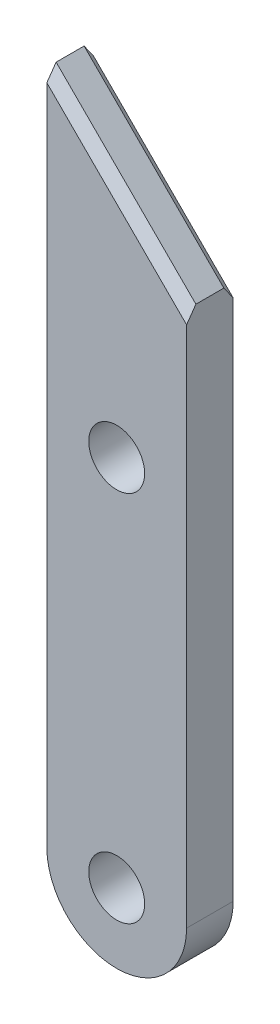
ISO-10303-21;
HEADER;
FILE_DESCRIPTION(('STEP AP214'),'2;1');
FILE_NAME('part.step','',(''),(''),'','','');
FILE_SCHEMA(('AUTOMOTIVE_DESIGN { 1 0 10303 214 1 1 1 1 }'));
ENDSEC;
DATA;
#1=APPLICATION_CONTEXT('core data for automotive mechanical design processes');
#2=APPLICATION_PROTOCOL_DEFINITION('international standard','automotive_design',2000,#1);
#3=PRODUCT_CONTEXT('',#1,'mechanical');
#4=PRODUCT('Part','Part','',(#3));
#5=PRODUCT_RELATED_PRODUCT_CATEGORY('part','',(#4));
#6=PRODUCT_DEFINITION_FORMATION('','',#4);
#7=PRODUCT_DEFINITION_CONTEXT('part definition',#1,'design');
#8=PRODUCT_DEFINITION('design','',#6,#7);
#9=PRODUCT_DEFINITION_SHAPE('','',#8);
#10=(LENGTH_UNIT() NAMED_UNIT(*) SI_UNIT(.MILLI.,.METRE.));
#11=(NAMED_UNIT(*) PLANE_ANGLE_UNIT() SI_UNIT($,.RADIAN.));
#12=(NAMED_UNIT(*) SI_UNIT($,.STERADIAN.) SOLID_ANGLE_UNIT());
#13=UNCERTAINTY_MEASURE_WITH_UNIT(LENGTH_MEASURE(1.E-05),#10,'distance_accuracy_value','');
#14=(GEOMETRIC_REPRESENTATION_CONTEXT(3) GLOBAL_UNCERTAINTY_ASSIGNED_CONTEXT((#13)) GLOBAL_UNIT_ASSIGNED_CONTEXT((#10,
#11,#12)) REPRESENTATION_CONTEXT('',''));
#15=CARTESIAN_POINT('',(0.,0.,0.));
#16=DIRECTION('',(0.,0.,1.));
#17=DIRECTION('',(1.,0.,0.));
#18=AXIS2_PLACEMENT_3D('',#15,#16,#17);
#19=CARTESIAN_POINT('',(0.,0.,10.));
#20=DIRECTION('',(1.,0.,0.));
#21=DIRECTION('',(0.,1.,0.));
#22=AXIS2_PLACEMENT_3D('',#19,#20,#21);
#23=PLANE('',#22);
#24=DIRECTION('',(0.,0.,-1.));
#25=VECTOR('',#24,1.);
#26=CARTESIAN_POINT('',(0.,0.,10.));
#27=LINE('',#26,#25);
#28=CARTESIAN_POINT('',(0.,0.,8.));
#29=VERTEX_POINT('',#28);
#30=CARTESIAN_POINT('',(0.,0.,1.99999999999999));
#31=VERTEX_POINT('',#30);
#32=EDGE_CURVE('E135',#29,#31,#27,.T.);
#33=ORIENTED_EDGE('',*,*,#32,.T.);
#34=DIRECTION('',(0.,0.816496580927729,0.577350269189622));
#35=VECTOR('',#34,1.);
#36=CARTESIAN_POINT('',(0.,0.,1.99999999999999));
#37=LINE('',#36,#35);
#38=CARTESIAN_POINT('',(0.,-2.82842712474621,0.));
#39=VERTEX_POINT('',#38);
#40=EDGE_CURVE('E123',#31,#39,#37,.F.);
#41=ORIENTED_EDGE('',*,*,#40,.T.);
#42=DIRECTION('',(0.,-1.,0.));
#43=VECTOR('',#42,1.);
#44=CARTESIAN_POINT('',(0.,0.,0.));
#45=LINE('',#44,#43);
#46=CARTESIAN_POINT('',(0.,-145.,0.));
#47=VERTEX_POINT('',#46);
#48=EDGE_CURVE('E109',#39,#47,#45,.T.);
#49=ORIENTED_EDGE('',*,*,#48,.T.);
#50=DIRECTION('',(0.,0.,-1.));
#51=VECTOR('',#50,1.);
#52=CARTESIAN_POINT('',(0.,-145.,10.));
#53=LINE('',#52,#51);
#54=CARTESIAN_POINT('',(0.,-145.,10.));
#55=VERTEX_POINT('',#54);
#56=EDGE_CURVE('E103',#55,#47,#53,.T.);
#57=ORIENTED_EDGE('',*,*,#56,.F.);
#58=DIRECTION('',(0.,-1.,0.));
#59=VECTOR('',#58,1.);
#60=CARTESIAN_POINT('',(0.,0.,10.));
#61=LINE('',#60,#59);
#62=CARTESIAN_POINT('',(0.,-2.82842712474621,10.));
#63=VERTEX_POINT('',#62);
#64=EDGE_CURVE('E90',#63,#55,#61,.T.);
#65=ORIENTED_EDGE('',*,*,#64,.F.);
#66=DIRECTION('',(0.,0.816496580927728,-0.577350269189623));
#67=VECTOR('',#66,1.);
#68=CARTESIAN_POINT('',(0.,-55.2189514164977,47.0456949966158));
#69=LINE('',#68,#67);
#70=EDGE_CURVE('E121',#63,#29,#69,.T.);
#71=ORIENTED_EDGE('',*,*,#70,.T.);
#72=EDGE_LOOP('',(#33,#41,#49,#57,#65,#71));
#73=FACE_BOUND('',#72,.T.);
#74=ADVANCED_FACE('F34',(#73),#23,.F.);
#75=CARTESIAN_POINT('',(15.,-145.,10.));
#76=DIRECTION('',(0.,0.,-1.));
#77=DIRECTION('',(-1.,0.,0.));
#78=AXIS2_PLACEMENT_3D('',#75,#76,#77);
#79=CYLINDRICAL_SURFACE('',#78,15.);
#80=CARTESIAN_POINT('',(15.,-145.,0.));
#81=DIRECTION('',(0.,0.,1.));
#82=DIRECTION('',(1.,0.,0.));
#83=AXIS2_PLACEMENT_3D('',#80,#81,#82);
#84=CIRCLE('',#83,15.);
#85=CARTESIAN_POINT('',(30.,-145.,0.));
#86=VERTEX_POINT('',#85);
#87=EDGE_CURVE('E138',#47,#86,#84,.T.);
#88=ORIENTED_EDGE('',*,*,#87,.T.);
#89=DIRECTION('',(0.,0.,-1.));
#90=VECTOR('',#89,1.);
#91=CARTESIAN_POINT('',(30.,-145.,10.));
#92=LINE('',#91,#90);
#93=CARTESIAN_POINT('',(30.,-145.,10.));
#94=VERTEX_POINT('',#93);
#95=EDGE_CURVE('E105',#94,#86,#92,.T.);
#96=ORIENTED_EDGE('',*,*,#95,.F.);
#97=CARTESIAN_POINT('',(15.,-145.,10.));
#98=DIRECTION('',(0.,0.,1.));
#99=DIRECTION('',(1.,0.,0.));
#100=AXIS2_PLACEMENT_3D('',#97,#98,#99);
#101=CIRCLE('',#100,15.);
#102=EDGE_CURVE('E93',#55,#94,#101,.T.);
#103=ORIENTED_EDGE('',*,*,#102,.F.);
#104=ORIENTED_EDGE('',*,*,#56,.T.);
#105=EDGE_LOOP('',(#88,#96,#103,#104));
#106=FACE_BOUND('',#105,.T.);
#107=ADVANCED_FACE('F102',(#106),#79,.T.);
#108=CARTESIAN_POINT('',(30.,-30.,10.));
#109=DIRECTION('',(-1.,0.,0.));
#110=DIRECTION('',(0.,-1.,0.));
#111=AXIS2_PLACEMENT_3D('',#108,#109,#110);
#112=PLANE('',#111);
#113=DIRECTION('',(0.,1.,0.));
#114=VECTOR('',#113,1.);
#115=CARTESIAN_POINT('',(30.,-30.,0.));
#116=LINE('',#115,#114);
#117=CARTESIAN_POINT('',(30.,-32.8284271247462,0.));
#118=VERTEX_POINT('',#117);
#119=EDGE_CURVE('E98',#86,#118,#116,.T.);
#120=ORIENTED_EDGE('',*,*,#119,.T.);
#121=DIRECTION('',(0.,-0.816496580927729,-0.577350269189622));
#122=VECTOR('',#121,1.);
#123=CARTESIAN_POINT('',(30.,-9.99999999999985,16.1421356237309));
#124=LINE('',#123,#122);
#125=CARTESIAN_POINT('',(30.,-30.,1.99999999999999));
#126=VERTEX_POINT('',#125);
#127=EDGE_CURVE('E42',#118,#126,#124,.F.);
#128=ORIENTED_EDGE('',*,*,#127,.T.);
#129=DIRECTION('',(0.,0.,-1.));
#130=VECTOR('',#129,1.);
#131=CARTESIAN_POINT('',(30.,-30.,10.));
#132=LINE('',#131,#130);
#133=CARTESIAN_POINT('',(30.,-30.,8.));
#134=VERTEX_POINT('',#133);
#135=EDGE_CURVE('E115',#134,#126,#132,.T.);
#136=ORIENTED_EDGE('',*,*,#135,.F.);
#137=DIRECTION('',(0.,-0.816496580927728,0.577350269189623));
#138=VECTOR('',#137,1.);
#139=CARTESIAN_POINT('',(30.,-65.2189514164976,32.9035593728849));
#140=LINE('',#139,#138);
#141=CARTESIAN_POINT('',(30.,-32.8284271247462,10.));
#142=VERTEX_POINT('',#141);
#143=EDGE_CURVE('E49',#134,#142,#140,.T.);
#144=ORIENTED_EDGE('',*,*,#143,.T.);
#145=DIRECTION('',(0.,1.,0.));
#146=VECTOR('',#145,1.);
#147=CARTESIAN_POINT('',(30.,-30.,10.));
#148=LINE('',#147,#146);
#149=EDGE_CURVE('E106',#94,#142,#148,.T.);
#150=ORIENTED_EDGE('',*,*,#149,.F.);
#151=ORIENTED_EDGE('',*,*,#95,.T.);
#152=EDGE_LOOP('',(#120,#128,#136,#144,#150,#151));
#153=FACE_BOUND('',#152,.T.);
#154=ADVANCED_FACE('F128',(#153),#112,.F.);
#155=CARTESIAN_POINT('',(0.,0.,10.));
#156=DIRECTION('',(-0.707106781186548,-0.707106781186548,0.));
#157=DIRECTION('',(0.707106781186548,-0.707106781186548,0.));
#158=AXIS2_PLACEMENT_3D('',#155,#156,#157);
#159=PLANE('',#158);
#160=ORIENTED_EDGE('',*,*,#135,.T.);
#161=DIRECTION('',(-0.707106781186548,0.707106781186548,0.));
#162=VECTOR('',#161,1.);
#163=CARTESIAN_POINT('',(0.,0.,1.99999999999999));
#164=LINE('',#163,#162);
#165=EDGE_CURVE('E113',#126,#31,#164,.T.);
#166=ORIENTED_EDGE('',*,*,#165,.T.);
#167=ORIENTED_EDGE('',*,*,#32,.F.);
#168=DIRECTION('',(0.707106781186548,-0.707106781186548,0.));
#169=VECTOR('',#168,1.);
#170=CARTESIAN_POINT('',(30.,-30.,8.));
#171=LINE('',#170,#169);
#172=EDGE_CURVE('E111',#29,#134,#171,.T.);
#173=ORIENTED_EDGE('',*,*,#172,.T.);
#174=EDGE_LOOP('',(#160,#166,#167,#173));
#175=FACE_BOUND('',#174,.T.);
#176=ADVANCED_FACE('F132',(#175),#159,.F.);
#177=CARTESIAN_POINT('',(15.,-145.,10.));
#178=DIRECTION('',(0.,0.,1.));
#179=DIRECTION('',(1.,0.,0.));
#180=AXIS2_PLACEMENT_3D('',#177,#178,#179);
#181=PLANE('',#180);
#182=CARTESIAN_POINT('',(15.,-65.,10.));
#183=DIRECTION('',(0.,0.,1.));
#184=DIRECTION('',(1.,0.,0.));
#185=AXIS2_PLACEMENT_3D('',#182,#183,#184);
#186=CIRCLE('',#185,6.);
#187=CARTESIAN_POINT('',(21.,-65.,10.));
#188=VERTEX_POINT('',#187);
#189=EDGE_CURVE('E185',#188,#188,#186,.T.);
#190=ORIENTED_EDGE('',*,*,#189,.F.);
#191=EDGE_LOOP('',(#190));
#192=FACE_BOUND('',#191,.T.);
#193=CARTESIAN_POINT('',(15.,-145.,10.));
#194=DIRECTION('',(0.,0.,1.));
#195=DIRECTION('',(1.,0.,0.));
#196=AXIS2_PLACEMENT_3D('',#193,#194,#195);
#197=CIRCLE('',#196,6.);
#198=CARTESIAN_POINT('',(21.,-145.,10.));
#199=VERTEX_POINT('',#198);
#200=EDGE_CURVE('E143',#199,#199,#197,.T.);
#201=ORIENTED_EDGE('',*,*,#200,.F.);
#202=EDGE_LOOP('',(#201));
#203=FACE_BOUND('',#202,.T.);
#204=ORIENTED_EDGE('',*,*,#149,.T.);
#205=DIRECTION('',(-0.707106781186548,0.707106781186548,0.));
#206=VECTOR('',#205,1.);
#207=CARTESIAN_POINT('',(-1.4142135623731,-1.4142135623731,10.));
#208=LINE('',#207,#206);
#209=EDGE_CURVE('E11',#142,#63,#208,.T.);
#210=ORIENTED_EDGE('',*,*,#209,.T.);
#211=ORIENTED_EDGE('',*,*,#64,.T.);
#212=ORIENTED_EDGE('',*,*,#102,.T.);
#213=EDGE_LOOP('',(#204,#210,#211,#212));
#214=FACE_BOUND('',#213,.T.);
#215=ADVANCED_FACE('F92',(#192,#203,#214),#181,.T.);
#216=CARTESIAN_POINT('',(15.,-145.,0.));
#217=DIRECTION('',(0.,0.,1.));
#218=DIRECTION('',(1.,0.,0.));
#219=AXIS2_PLACEMENT_3D('',#216,#217,#218);
#220=PLANE('',#219);
#221=CARTESIAN_POINT('',(15.,-65.,0.));
#222=DIRECTION('',(0.,0.,1.));
#223=DIRECTION('',(1.,0.,0.));
#224=AXIS2_PLACEMENT_3D('',#221,#222,#223);
#225=CIRCLE('',#224,6.);
#226=CARTESIAN_POINT('',(21.,-65.,0.));
#227=VERTEX_POINT('',#226);
#228=EDGE_CURVE('E182',#227,#227,#225,.T.);
#229=ORIENTED_EDGE('',*,*,#228,.T.);
#230=EDGE_LOOP('',(#229));
#231=FACE_BOUND('',#230,.T.);
#232=CARTESIAN_POINT('',(15.,-145.,0.));
#233=DIRECTION('',(0.,0.,1.));
#234=DIRECTION('',(1.,0.,0.));
#235=AXIS2_PLACEMENT_3D('',#232,#233,#234);
#236=CIRCLE('',#235,6.);
#237=CARTESIAN_POINT('',(21.,-145.,0.));
#238=VERTEX_POINT('',#237);
#239=EDGE_CURVE('E139',#238,#238,#236,.T.);
#240=ORIENTED_EDGE('',*,*,#239,.T.);
#241=EDGE_LOOP('',(#240));
#242=FACE_BOUND('',#241,.T.);
#243=ORIENTED_EDGE('',*,*,#48,.F.);
#244=DIRECTION('',(0.707106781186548,-0.707106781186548,0.));
#245=VECTOR('',#244,1.);
#246=CARTESIAN_POINT('',(78.5857864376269,-81.4142135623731,0.));
#247=LINE('',#246,#245);
#248=EDGE_CURVE('E57',#39,#118,#247,.T.);
#249=ORIENTED_EDGE('',*,*,#248,.T.);
#250=ORIENTED_EDGE('',*,*,#119,.F.);
#251=ORIENTED_EDGE('',*,*,#87,.F.);
#252=EDGE_LOOP('',(#243,#249,#250,#251));
#253=FACE_BOUND('',#252,.T.);
#254=ADVANCED_FACE('F137',(#231,#242,#253),#220,.F.);
#255=CARTESIAN_POINT('',(15.,-145.,0.));
#256=DIRECTION('',(0.,0.,1.));
#257=DIRECTION('',(1.,0.,0.));
#258=AXIS2_PLACEMENT_3D('',#255,#256,#257);
#259=CYLINDRICAL_SURFACE('',#258,6.);
#260=ORIENTED_EDGE('',*,*,#239,.F.);
#261=EDGE_LOOP('',(#260));
#262=FACE_BOUND('',#261,.T.);
#263=ORIENTED_EDGE('',*,*,#200,.T.);
#264=EDGE_LOOP('',(#263));
#265=FACE_BOUND('',#264,.T.);
#266=ADVANCED_FACE('F167',(#262,#265),#259,.F.);
#267=CARTESIAN_POINT('',(15.,-65.,0.));
#268=DIRECTION('',(0.,0.,1.));
#269=DIRECTION('',(1.,0.,0.));
#270=AXIS2_PLACEMENT_3D('',#267,#268,#269);
#271=CYLINDRICAL_SURFACE('',#270,6.);
#272=ORIENTED_EDGE('',*,*,#228,.F.);
#273=EDGE_LOOP('',(#272));
#274=FACE_BOUND('',#273,.T.);
#275=ORIENTED_EDGE('',*,*,#189,.T.);
#276=EDGE_LOOP('',(#275));
#277=FACE_BOUND('',#276,.T.);
#278=ADVANCED_FACE('F153',(#274,#277),#271,.F.);
#279=CARTESIAN_POINT('',(0.,0.,1.99999999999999));
#280=DIRECTION('',(-0.499999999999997,-0.499999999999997,0.707106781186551));
#281=DIRECTION('',(0.816496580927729,0.,0.577350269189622));
#282=AXIS2_PLACEMENT_3D('',#279,#280,#281);
#283=PLANE('',#282);
#284=ORIENTED_EDGE('',*,*,#127,.F.);
#285=ORIENTED_EDGE('',*,*,#248,.F.);
#286=ORIENTED_EDGE('',*,*,#40,.F.);
#287=ORIENTED_EDGE('',*,*,#165,.F.);
#288=EDGE_LOOP('',(#284,#285,#286,#287));
#289=FACE_BOUND('',#288,.T.);
#290=ADVANCED_FACE('F136',(#289),#283,.F.);
#291=CARTESIAN_POINT('',(78.5857864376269,-81.4142135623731,10.));
#292=DIRECTION('',(0.499999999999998,0.499999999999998,0.70710678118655));
#293=DIRECTION('',(0.816496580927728,0.,-0.577350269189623));
#294=AXIS2_PLACEMENT_3D('',#291,#292,#293);
#295=PLANE('',#294);
#296=ORIENTED_EDGE('',*,*,#143,.F.);
#297=ORIENTED_EDGE('',*,*,#172,.F.);
#298=ORIENTED_EDGE('',*,*,#70,.F.);
#299=ORIENTED_EDGE('',*,*,#209,.F.);
#300=EDGE_LOOP('',(#296,#297,#298,#299));
#301=FACE_BOUND('',#300,.T.);
#302=ADVANCED_FACE('F36',(#301),#295,.T.);
#303=CLOSED_SHELL('',(#74,#107,#154,#176,#215,#254,#266,#278,#290,#302));
#304=MANIFOLD_SOLID_BREP('B2',#303);
#305=ADVANCED_BREP_SHAPE_REPRESENTATION('',(#18,#304),#14);
#306=SHAPE_DEFINITION_REPRESENTATION(#9,#305);
ENDSEC;
END-ISO-10303-21;
